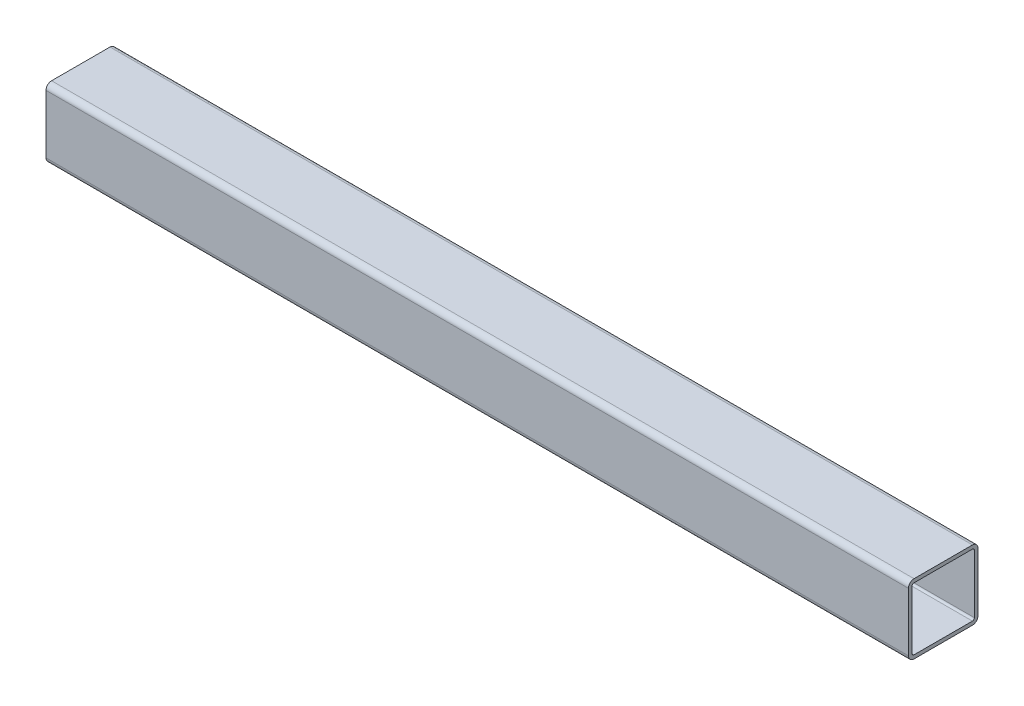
ISO-10303-21;
HEADER;
FILE_DESCRIPTION(('STEP AP214'),'2;1');
FILE_NAME('part.step','',(''),(''),'','','');
FILE_SCHEMA(('AUTOMOTIVE_DESIGN { 1 0 10303 214 1 1 1 1 }'));
ENDSEC;
DATA;
#1=APPLICATION_CONTEXT('core data for automotive mechanical design processes');
#2=APPLICATION_PROTOCOL_DEFINITION('international standard','automotive_design',2000,#1);
#3=PRODUCT_CONTEXT('',#1,'mechanical');
#4=PRODUCT('Part','Part','',(#3));
#5=PRODUCT_RELATED_PRODUCT_CATEGORY('part','',(#4));
#6=PRODUCT_DEFINITION_FORMATION('','',#4);
#7=PRODUCT_DEFINITION_CONTEXT('part definition',#1,'design');
#8=PRODUCT_DEFINITION('design','',#6,#7);
#9=PRODUCT_DEFINITION_SHAPE('','',#8);
#10=(LENGTH_UNIT() NAMED_UNIT(*) SI_UNIT(.MILLI.,.METRE.));
#11=(NAMED_UNIT(*) PLANE_ANGLE_UNIT() SI_UNIT($,.RADIAN.));
#12=(NAMED_UNIT(*) SI_UNIT($,.STERADIAN.) SOLID_ANGLE_UNIT());
#13=UNCERTAINTY_MEASURE_WITH_UNIT(LENGTH_MEASURE(1.E-05),#10,'distance_accuracy_value','');
#14=(GEOMETRIC_REPRESENTATION_CONTEXT(3) GLOBAL_UNCERTAINTY_ASSIGNED_CONTEXT((#13)) GLOBAL_UNIT_ASSIGNED_CONTEXT((#10,
#11,#12)) REPRESENTATION_CONTEXT('',''));
#15=CARTESIAN_POINT('',(0.,0.,0.));
#16=DIRECTION('',(0.,0.,1.));
#17=DIRECTION('',(1.,0.,0.));
#18=AXIS2_PLACEMENT_3D('',#15,#16,#17);
#19=CARTESIAN_POINT('',(393.7,2.54,29.21));
#20=DIRECTION('',(1.,0.,0.));
#21=DIRECTION('',(0.,0.,-1.));
#22=AXIS2_PLACEMENT_3D('',#19,#20,#21);
#23=PLANE('',#22);
#24=CARTESIAN_POINT('',(393.7,2.54,29.21));
#25=DIRECTION('',(1.,0.,0.));
#26=DIRECTION('',(0.,0.,-1.));
#27=AXIS2_PLACEMENT_3D('',#24,#25,#26);
#28=CIRCLE('',#27,2.54);
#29=CARTESIAN_POINT('',(393.7,2.54000000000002,31.75));
#30=VERTEX_POINT('',#29);
#31=CARTESIAN_POINT('',(393.7,0.,29.21));
#32=VERTEX_POINT('',#31);
#33=EDGE_CURVE('E217',#30,#32,#28,.T.);
#34=ORIENTED_EDGE('',*,*,#33,.T.);
#35=DIRECTION('',(0.,0.,-1.));
#36=VECTOR('',#35,1.);
#37=CARTESIAN_POINT('',(393.7,0.,29.21));
#38=LINE('',#37,#36);
#39=CARTESIAN_POINT('',(393.7,0.,2.54000000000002));
#40=VERTEX_POINT('',#39);
#41=EDGE_CURVE('E220',#32,#40,#38,.T.);
#42=ORIENTED_EDGE('',*,*,#41,.T.);
#43=CARTESIAN_POINT('',(393.7,2.54,2.54));
#44=DIRECTION('',(1.,0.,0.));
#45=DIRECTION('',(0.,0.,1.));
#46=AXIS2_PLACEMENT_3D('',#43,#44,#45);
#47=CIRCLE('',#46,2.54);
#48=CARTESIAN_POINT('',(393.7,2.54000000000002,0.));
#49=VERTEX_POINT('',#48);
#50=EDGE_CURVE('E223',#40,#49,#47,.T.);
#51=ORIENTED_EDGE('',*,*,#50,.T.);
#52=DIRECTION('',(0.,1.,0.));
#53=VECTOR('',#52,1.);
#54=CARTESIAN_POINT('',(393.7,2.54000000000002,0.));
#55=LINE('',#54,#53);
#56=CARTESIAN_POINT('',(393.7,29.21,0.));
#57=VERTEX_POINT('',#56);
#58=EDGE_CURVE('E225',#49,#57,#55,.T.);
#59=ORIENTED_EDGE('',*,*,#58,.T.);
#60=CARTESIAN_POINT('',(393.7,29.21,2.54));
#61=DIRECTION('',(1.,0.,0.));
#62=DIRECTION('',(0.,0.,-1.));
#63=AXIS2_PLACEMENT_3D('',#60,#61,#62);
#64=CIRCLE('',#63,2.54);
#65=CARTESIAN_POINT('',(393.7,31.75,2.54000000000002));
#66=VERTEX_POINT('',#65);
#67=EDGE_CURVE('E227',#57,#66,#64,.T.);
#68=ORIENTED_EDGE('',*,*,#67,.T.);
#69=DIRECTION('',(0.,0.,1.));
#70=VECTOR('',#69,1.);
#71=CARTESIAN_POINT('',(393.7,31.75,2.54000000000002));
#72=LINE('',#71,#70);
#73=CARTESIAN_POINT('',(393.7,31.75,29.21));
#74=VERTEX_POINT('',#73);
#75=EDGE_CURVE('E229',#66,#74,#72,.T.);
#76=ORIENTED_EDGE('',*,*,#75,.T.);
#77=CARTESIAN_POINT('',(393.7,29.21,29.21));
#78=DIRECTION('',(1.,0.,0.));
#79=DIRECTION('',(0.,0.,1.));
#80=AXIS2_PLACEMENT_3D('',#77,#78,#79);
#81=CIRCLE('',#80,2.54);
#82=CARTESIAN_POINT('',(393.7,29.21,31.75));
#83=VERTEX_POINT('',#82);
#84=EDGE_CURVE('E231',#74,#83,#81,.T.);
#85=ORIENTED_EDGE('',*,*,#84,.T.);
#86=DIRECTION('',(0.,-1.,0.));
#87=VECTOR('',#86,1.);
#88=CARTESIAN_POINT('',(393.7,29.21,31.75));
#89=LINE('',#88,#87);
#90=EDGE_CURVE('E233',#83,#30,#89,.T.);
#91=ORIENTED_EDGE('',*,*,#90,.T.);
#92=EDGE_LOOP('',(#34,#42,#51,#59,#68,#76,#85,#91));
#93=FACE_BOUND('',#92,.T.);
#94=DIRECTION('',(0.,1.,0.));
#95=VECTOR('',#94,1.);
#96=CARTESIAN_POINT('',(393.7,2.54000000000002,1.651));
#97=LINE('',#96,#95);
#98=CARTESIAN_POINT('',(393.7,2.54000000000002,1.651));
#99=VERTEX_POINT('',#98);
#100=CARTESIAN_POINT('',(393.7,29.21,1.651));
#101=VERTEX_POINT('',#100);
#102=EDGE_CURVE('E160',#99,#101,#97,.T.);
#103=ORIENTED_EDGE('',*,*,#102,.F.);
#104=CARTESIAN_POINT('',(393.7,2.54,2.54));
#105=DIRECTION('',(1.,0.,0.));
#106=DIRECTION('',(0.,0.,1.));
#107=AXIS2_PLACEMENT_3D('',#104,#105,#106);
#108=CIRCLE('',#107,0.889);
#109=CARTESIAN_POINT('',(393.7,1.651,2.54000000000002));
#110=VERTEX_POINT('',#109);
#111=EDGE_CURVE('E152',#110,#99,#108,.T.);
#112=ORIENTED_EDGE('',*,*,#111,.F.);
#113=DIRECTION('',(0.,0.,-1.));
#114=VECTOR('',#113,1.);
#115=CARTESIAN_POINT('',(393.7,1.651,29.21));
#116=LINE('',#115,#114);
#117=CARTESIAN_POINT('',(393.7,1.651,29.21));
#118=VERTEX_POINT('',#117);
#119=EDGE_CURVE('E185',#118,#110,#116,.T.);
#120=ORIENTED_EDGE('',*,*,#119,.F.);
#121=CARTESIAN_POINT('',(393.7,2.54,29.21));
#122=DIRECTION('',(1.,0.,0.));
#123=DIRECTION('',(0.,0.,-1.));
#124=AXIS2_PLACEMENT_3D('',#121,#122,#123);
#125=CIRCLE('',#124,0.889000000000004);
#126=CARTESIAN_POINT('',(393.7,2.54000000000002,30.099));
#127=VERTEX_POINT('',#126);
#128=EDGE_CURVE('E183',#127,#118,#125,.T.);
#129=ORIENTED_EDGE('',*,*,#128,.F.);
#130=DIRECTION('',(0.,-1.,0.));
#131=VECTOR('',#130,1.);
#132=CARTESIAN_POINT('',(393.7,29.21,30.099));
#133=LINE('',#132,#131);
#134=CARTESIAN_POINT('',(393.7,29.21,30.099));
#135=VERTEX_POINT('',#134);
#136=EDGE_CURVE('E181',#135,#127,#133,.T.);
#137=ORIENTED_EDGE('',*,*,#136,.F.);
#138=CARTESIAN_POINT('',(393.7,29.21,29.21));
#139=DIRECTION('',(1.,0.,0.));
#140=DIRECTION('',(0.,0.,1.));
#141=AXIS2_PLACEMENT_3D('',#138,#139,#140);
#142=CIRCLE('',#141,0.889000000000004);
#143=CARTESIAN_POINT('',(393.7,30.099,29.21));
#144=VERTEX_POINT('',#143);
#145=EDGE_CURVE('E179',#144,#135,#142,.T.);
#146=ORIENTED_EDGE('',*,*,#145,.F.);
#147=DIRECTION('',(0.,0.,1.));
#148=VECTOR('',#147,1.);
#149=CARTESIAN_POINT('',(393.7,30.099,2.54000000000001));
#150=LINE('',#149,#148);
#151=CARTESIAN_POINT('',(393.7,30.099,2.54000000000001));
#152=VERTEX_POINT('',#151);
#153=EDGE_CURVE('E175',#152,#144,#150,.T.);
#154=ORIENTED_EDGE('',*,*,#153,.F.);
#155=CARTESIAN_POINT('',(393.7,29.21,2.54));
#156=DIRECTION('',(1.,0.,0.));
#157=DIRECTION('',(0.,0.,-1.));
#158=AXIS2_PLACEMENT_3D('',#155,#156,#157);
#159=CIRCLE('',#158,0.889);
#160=EDGE_CURVE('E173',#101,#152,#159,.T.);
#161=ORIENTED_EDGE('',*,*,#160,.F.);
#162=EDGE_LOOP('',(#103,#112,#120,#129,#137,#146,#154,#161));
#163=FACE_BOUND('',#162,.T.);
#164=ADVANCED_FACE('F39',(#93,#163),#23,.T.);
#165=CARTESIAN_POINT('',(0.,2.54,29.21));
#166=DIRECTION('',(1.,0.,0.));
#167=DIRECTION('',(0.,0.,-1.));
#168=AXIS2_PLACEMENT_3D('',#165,#166,#167);
#169=PLANE('',#168);
#170=CARTESIAN_POINT('',(0.,2.54,29.21));
#171=DIRECTION('',(1.,0.,0.));
#172=DIRECTION('',(0.,0.,-1.));
#173=AXIS2_PLACEMENT_3D('',#170,#171,#172);
#174=CIRCLE('',#173,2.54);
#175=CARTESIAN_POINT('',(0.,2.54000000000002,31.75));
#176=VERTEX_POINT('',#175);
#177=CARTESIAN_POINT('',(0.,0.,29.21));
#178=VERTEX_POINT('',#177);
#179=EDGE_CURVE('E168',#176,#178,#174,.T.);
#180=ORIENTED_EDGE('',*,*,#179,.F.);
#181=DIRECTION('',(0.,-1.,0.));
#182=VECTOR('',#181,1.);
#183=CARTESIAN_POINT('',(0.,29.21,31.75));
#184=LINE('',#183,#182);
#185=CARTESIAN_POINT('',(0.,29.21,31.75));
#186=VERTEX_POINT('',#185);
#187=EDGE_CURVE('E221',#186,#176,#184,.T.);
#188=ORIENTED_EDGE('',*,*,#187,.F.);
#189=CARTESIAN_POINT('',(0.,29.21,29.21));
#190=DIRECTION('',(1.,0.,0.));
#191=DIRECTION('',(0.,0.,1.));
#192=AXIS2_PLACEMENT_3D('',#189,#190,#191);
#193=CIRCLE('',#192,2.54);
#194=CARTESIAN_POINT('',(0.,31.75,29.21));
#195=VERTEX_POINT('',#194);
#196=EDGE_CURVE('E248',#195,#186,#193,.T.);
#197=ORIENTED_EDGE('',*,*,#196,.F.);
#198=DIRECTION('',(0.,0.,1.));
#199=VECTOR('',#198,1.);
#200=CARTESIAN_POINT('',(0.,31.75,2.54000000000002));
#201=LINE('',#200,#199);
#202=CARTESIAN_POINT('',(0.,31.75,2.54000000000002));
#203=VERTEX_POINT('',#202);
#204=EDGE_CURVE('E246',#203,#195,#201,.T.);
#205=ORIENTED_EDGE('',*,*,#204,.F.);
#206=CARTESIAN_POINT('',(0.,29.21,2.54));
#207=DIRECTION('',(1.,0.,0.));
#208=DIRECTION('',(0.,0.,-1.));
#209=AXIS2_PLACEMENT_3D('',#206,#207,#208);
#210=CIRCLE('',#209,2.54);
#211=CARTESIAN_POINT('',(0.,29.21,0.));
#212=VERTEX_POINT('',#211);
#213=EDGE_CURVE('E244',#212,#203,#210,.T.);
#214=ORIENTED_EDGE('',*,*,#213,.F.);
#215=DIRECTION('',(0.,1.,0.));
#216=VECTOR('',#215,1.);
#217=CARTESIAN_POINT('',(0.,2.54000000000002,0.));
#218=LINE('',#217,#216);
#219=CARTESIAN_POINT('',(0.,2.54000000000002,0.));
#220=VERTEX_POINT('',#219);
#221=EDGE_CURVE('E242',#220,#212,#218,.T.);
#222=ORIENTED_EDGE('',*,*,#221,.F.);
#223=CARTESIAN_POINT('',(0.,2.54,2.54));
#224=DIRECTION('',(1.,0.,0.));
#225=DIRECTION('',(0.,0.,1.));
#226=AXIS2_PLACEMENT_3D('',#223,#224,#225);
#227=CIRCLE('',#226,2.54);
#228=CARTESIAN_POINT('',(0.,0.,2.54000000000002));
#229=VERTEX_POINT('',#228);
#230=EDGE_CURVE('E240',#229,#220,#227,.T.);
#231=ORIENTED_EDGE('',*,*,#230,.F.);
#232=DIRECTION('',(0.,0.,-1.));
#233=VECTOR('',#232,1.);
#234=CARTESIAN_POINT('',(0.,0.,29.21));
#235=LINE('',#234,#233);
#236=EDGE_CURVE('E238',#178,#229,#235,.T.);
#237=ORIENTED_EDGE('',*,*,#236,.F.);
#238=EDGE_LOOP('',(#180,#188,#197,#205,#214,#222,#231,#237));
#239=FACE_BOUND('',#238,.T.);
#240=CARTESIAN_POINT('',(0.,2.54,2.54));
#241=DIRECTION('',(1.,0.,0.));
#242=DIRECTION('',(0.,0.,1.));
#243=AXIS2_PLACEMENT_3D('',#240,#241,#242);
#244=CIRCLE('',#243,0.889);
#245=CARTESIAN_POINT('',(0.,1.651,2.54000000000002));
#246=VERTEX_POINT('',#245);
#247=CARTESIAN_POINT('',(0.,2.54000000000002,1.651));
#248=VERTEX_POINT('',#247);
#249=EDGE_CURVE('E62',#246,#248,#244,.T.);
#250=ORIENTED_EDGE('',*,*,#249,.T.);
#251=DIRECTION('',(0.,1.,0.));
#252=VECTOR('',#251,1.);
#253=CARTESIAN_POINT('',(0.,2.54000000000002,1.651));
#254=LINE('',#253,#252);
#255=CARTESIAN_POINT('',(0.,29.21,1.651));
#256=VERTEX_POINT('',#255);
#257=EDGE_CURVE('E167',#248,#256,#254,.T.);
#258=ORIENTED_EDGE('',*,*,#257,.T.);
#259=CARTESIAN_POINT('',(0.,29.21,2.54));
#260=DIRECTION('',(1.,0.,0.));
#261=DIRECTION('',(0.,0.,-1.));
#262=AXIS2_PLACEMENT_3D('',#259,#260,#261);
#263=CIRCLE('',#262,0.889);
#264=CARTESIAN_POINT('',(0.,30.099,2.54000000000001));
#265=VERTEX_POINT('',#264);
#266=EDGE_CURVE('E189',#256,#265,#263,.T.);
#267=ORIENTED_EDGE('',*,*,#266,.T.);
#268=DIRECTION('',(0.,0.,1.));
#269=VECTOR('',#268,1.);
#270=CARTESIAN_POINT('',(0.,30.099,2.54000000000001));
#271=LINE('',#270,#269);
#272=CARTESIAN_POINT('',(0.,30.099,29.21));
#273=VERTEX_POINT('',#272);
#274=EDGE_CURVE('E192',#265,#273,#271,.T.);
#275=ORIENTED_EDGE('',*,*,#274,.T.);
#276=CARTESIAN_POINT('',(0.,29.21,29.21));
#277=DIRECTION('',(1.,0.,0.));
#278=DIRECTION('',(0.,0.,1.));
#279=AXIS2_PLACEMENT_3D('',#276,#277,#278);
#280=CIRCLE('',#279,0.889000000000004);
#281=CARTESIAN_POINT('',(0.,29.21,30.099));
#282=VERTEX_POINT('',#281);
#283=EDGE_CURVE('E195',#273,#282,#280,.T.);
#284=ORIENTED_EDGE('',*,*,#283,.T.);
#285=DIRECTION('',(0.,-1.,0.));
#286=VECTOR('',#285,1.);
#287=CARTESIAN_POINT('',(0.,29.21,30.099));
#288=LINE('',#287,#286);
#289=CARTESIAN_POINT('',(0.,2.54000000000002,30.099));
#290=VERTEX_POINT('',#289);
#291=EDGE_CURVE('E198',#282,#290,#288,.T.);
#292=ORIENTED_EDGE('',*,*,#291,.T.);
#293=CARTESIAN_POINT('',(0.,2.54,29.21));
#294=DIRECTION('',(1.,0.,0.));
#295=DIRECTION('',(0.,0.,-1.));
#296=AXIS2_PLACEMENT_3D('',#293,#294,#295);
#297=CIRCLE('',#296,0.889000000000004);
#298=CARTESIAN_POINT('',(0.,1.651,29.21));
#299=VERTEX_POINT('',#298);
#300=EDGE_CURVE('E201',#290,#299,#297,.T.);
#301=ORIENTED_EDGE('',*,*,#300,.T.);
#302=DIRECTION('',(0.,0.,-1.));
#303=VECTOR('',#302,1.);
#304=CARTESIAN_POINT('',(0.,1.651,29.21));
#305=LINE('',#304,#303);
#306=EDGE_CURVE('E161',#299,#246,#305,.T.);
#307=ORIENTED_EDGE('',*,*,#306,.T.);
#308=EDGE_LOOP('',(#250,#258,#267,#275,#284,#292,#301,#307));
#309=FACE_BOUND('',#308,.T.);
#310=ADVANCED_FACE('F278',(#239,#309),#169,.F.);
#311=CARTESIAN_POINT('',(393.7,2.54,29.21));
#312=DIRECTION('',(-1.,0.,0.));
#313=DIRECTION('',(0.,0.,1.));
#314=AXIS2_PLACEMENT_3D('',#311,#312,#313);
#315=CYLINDRICAL_SURFACE('',#314,2.54);
#316=ORIENTED_EDGE('',*,*,#179,.T.);
#317=DIRECTION('',(-1.,0.,0.));
#318=VECTOR('',#317,1.);
#319=CARTESIAN_POINT('',(393.7,0.,29.21));
#320=LINE('',#319,#318);
#321=EDGE_CURVE('E11',#32,#178,#320,.T.);
#322=ORIENTED_EDGE('',*,*,#321,.F.);
#323=ORIENTED_EDGE('',*,*,#33,.F.);
#324=DIRECTION('',(-1.,0.,0.));
#325=VECTOR('',#324,1.);
#326=CARTESIAN_POINT('',(393.7,2.54000000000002,31.75));
#327=LINE('',#326,#325);
#328=EDGE_CURVE('E235',#30,#176,#327,.T.);
#329=ORIENTED_EDGE('',*,*,#328,.T.);
#330=EDGE_LOOP('',(#316,#322,#323,#329));
#331=FACE_BOUND('',#330,.T.);
#332=ADVANCED_FACE('F41',(#331),#315,.T.);
#333=CARTESIAN_POINT('',(393.7,0.,29.21));
#334=DIRECTION('',(0.,1.,0.));
#335=DIRECTION('',(0.,0.,1.));
#336=AXIS2_PLACEMENT_3D('',#333,#334,#335);
#337=PLANE('',#336);
#338=ORIENTED_EDGE('',*,*,#236,.T.);
#339=DIRECTION('',(-1.,0.,0.));
#340=VECTOR('',#339,1.);
#341=CARTESIAN_POINT('',(393.7,0.,2.54000000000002));
#342=LINE('',#341,#340);
#343=EDGE_CURVE('E47',#40,#229,#342,.T.);
#344=ORIENTED_EDGE('',*,*,#343,.F.);
#345=ORIENTED_EDGE('',*,*,#41,.F.);
#346=ORIENTED_EDGE('',*,*,#321,.T.);
#347=EDGE_LOOP('',(#338,#344,#345,#346));
#348=FACE_BOUND('',#347,.T.);
#349=ADVANCED_FACE('F295',(#348),#337,.F.);
#350=CARTESIAN_POINT('',(393.7,2.54,2.54));
#351=DIRECTION('',(-1.,0.,0.));
#352=DIRECTION('',(0.,0.,1.));
#353=AXIS2_PLACEMENT_3D('',#350,#351,#352);
#354=CYLINDRICAL_SURFACE('',#353,2.54);
#355=ORIENTED_EDGE('',*,*,#230,.T.);
#356=DIRECTION('',(-1.,0.,0.));
#357=VECTOR('',#356,1.);
#358=CARTESIAN_POINT('',(393.7,2.54000000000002,0.));
#359=LINE('',#358,#357);
#360=EDGE_CURVE('E265',#49,#220,#359,.T.);
#361=ORIENTED_EDGE('',*,*,#360,.F.);
#362=ORIENTED_EDGE('',*,*,#50,.F.);
#363=ORIENTED_EDGE('',*,*,#343,.T.);
#364=EDGE_LOOP('',(#355,#361,#362,#363));
#365=FACE_BOUND('',#364,.T.);
#366=ADVANCED_FACE('F272',(#365),#354,.T.);
#367=CARTESIAN_POINT('',(393.7,2.54000000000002,0.));
#368=DIRECTION('',(0.,0.,1.));
#369=DIRECTION('',(1.,0.,0.));
#370=AXIS2_PLACEMENT_3D('',#367,#368,#369);
#371=PLANE('',#370);
#372=ORIENTED_EDGE('',*,*,#221,.T.);
#373=DIRECTION('',(-1.,0.,0.));
#374=VECTOR('',#373,1.);
#375=CARTESIAN_POINT('',(393.7,29.21,0.));
#376=LINE('',#375,#374);
#377=EDGE_CURVE('E262',#57,#212,#376,.T.);
#378=ORIENTED_EDGE('',*,*,#377,.F.);
#379=ORIENTED_EDGE('',*,*,#58,.F.);
#380=ORIENTED_EDGE('',*,*,#360,.T.);
#381=EDGE_LOOP('',(#372,#378,#379,#380));
#382=FACE_BOUND('',#381,.T.);
#383=ADVANCED_FACE('F284',(#382),#371,.F.);
#384=CARTESIAN_POINT('',(393.7,29.21,2.54));
#385=DIRECTION('',(-1.,0.,0.));
#386=DIRECTION('',(0.,0.,1.));
#387=AXIS2_PLACEMENT_3D('',#384,#385,#386);
#388=CYLINDRICAL_SURFACE('',#387,2.54);
#389=ORIENTED_EDGE('',*,*,#213,.T.);
#390=DIRECTION('',(-1.,0.,0.));
#391=VECTOR('',#390,1.);
#392=CARTESIAN_POINT('',(393.7,31.75,2.54000000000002));
#393=LINE('',#392,#391);
#394=EDGE_CURVE('E259',#66,#203,#393,.T.);
#395=ORIENTED_EDGE('',*,*,#394,.F.);
#396=ORIENTED_EDGE('',*,*,#67,.F.);
#397=ORIENTED_EDGE('',*,*,#377,.T.);
#398=EDGE_LOOP('',(#389,#395,#396,#397));
#399=FACE_BOUND('',#398,.T.);
#400=ADVANCED_FACE('F288',(#399),#388,.T.);
#401=CARTESIAN_POINT('',(393.7,31.75,2.54000000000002));
#402=DIRECTION('',(0.,-1.,0.));
#403=DIRECTION('',(0.,0.,-1.));
#404=AXIS2_PLACEMENT_3D('',#401,#402,#403);
#405=PLANE('',#404);
#406=ORIENTED_EDGE('',*,*,#204,.T.);
#407=DIRECTION('',(-1.,0.,0.));
#408=VECTOR('',#407,1.);
#409=CARTESIAN_POINT('',(393.7,31.75,29.21));
#410=LINE('',#409,#408);
#411=EDGE_CURVE('E256',#74,#195,#410,.T.);
#412=ORIENTED_EDGE('',*,*,#411,.F.);
#413=ORIENTED_EDGE('',*,*,#75,.F.);
#414=ORIENTED_EDGE('',*,*,#394,.T.);
#415=EDGE_LOOP('',(#406,#412,#413,#414));
#416=FACE_BOUND('',#415,.T.);
#417=ADVANCED_FACE('F308',(#416),#405,.F.);
#418=CARTESIAN_POINT('',(393.7,29.21,29.21));
#419=DIRECTION('',(-1.,0.,0.));
#420=DIRECTION('',(0.,0.,1.));
#421=AXIS2_PLACEMENT_3D('',#418,#419,#420);
#422=CYLINDRICAL_SURFACE('',#421,2.54);
#423=ORIENTED_EDGE('',*,*,#196,.T.);
#424=DIRECTION('',(-1.,0.,0.));
#425=VECTOR('',#424,1.);
#426=CARTESIAN_POINT('',(393.7,29.21,31.75));
#427=LINE('',#426,#425);
#428=EDGE_CURVE('E253',#83,#186,#427,.T.);
#429=ORIENTED_EDGE('',*,*,#428,.F.);
#430=ORIENTED_EDGE('',*,*,#84,.F.);
#431=ORIENTED_EDGE('',*,*,#411,.T.);
#432=EDGE_LOOP('',(#423,#429,#430,#431));
#433=FACE_BOUND('',#432,.T.);
#434=ADVANCED_FACE('F306',(#433),#422,.T.);
#435=CARTESIAN_POINT('',(393.7,29.21,31.75));
#436=DIRECTION('',(0.,0.,-1.));
#437=DIRECTION('',(0.,1.,0.));
#438=AXIS2_PLACEMENT_3D('',#435,#436,#437);
#439=PLANE('',#438);
#440=ORIENTED_EDGE('',*,*,#187,.T.);
#441=ORIENTED_EDGE('',*,*,#328,.F.);
#442=ORIENTED_EDGE('',*,*,#90,.F.);
#443=ORIENTED_EDGE('',*,*,#428,.T.);
#444=EDGE_LOOP('',(#440,#441,#442,#443));
#445=FACE_BOUND('',#444,.T.);
#446=ADVANCED_FACE('F301',(#445),#439,.F.);
#447=CARTESIAN_POINT('',(393.7,2.54,2.54));
#448=DIRECTION('',(-1.,0.,0.));
#449=DIRECTION('',(0.,0.,1.));
#450=AXIS2_PLACEMENT_3D('',#447,#448,#449);
#451=CYLINDRICAL_SURFACE('',#450,0.889);
#452=ORIENTED_EDGE('',*,*,#249,.F.);
#453=DIRECTION('',(-1.,0.,0.));
#454=VECTOR('',#453,1.);
#455=CARTESIAN_POINT('',(393.7,1.651,2.54000000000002));
#456=LINE('',#455,#454);
#457=EDGE_CURVE('E156',#110,#246,#456,.T.);
#458=ORIENTED_EDGE('',*,*,#457,.F.);
#459=ORIENTED_EDGE('',*,*,#111,.T.);
#460=DIRECTION('',(-1.,0.,0.));
#461=VECTOR('',#460,1.);
#462=CARTESIAN_POINT('',(393.7,2.54000000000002,1.651));
#463=LINE('',#462,#461);
#464=EDGE_CURVE('E155',#99,#248,#463,.T.);
#465=ORIENTED_EDGE('',*,*,#464,.T.);
#466=EDGE_LOOP('',(#452,#458,#459,#465));
#467=FACE_BOUND('',#466,.T.);
#468=ADVANCED_FACE('F154',(#467),#451,.F.);
#469=CARTESIAN_POINT('',(393.7,2.54000000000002,1.651));
#470=DIRECTION('',(0.,0.,1.));
#471=DIRECTION('',(1.,0.,0.));
#472=AXIS2_PLACEMENT_3D('',#469,#470,#471);
#473=PLANE('',#472);
#474=ORIENTED_EDGE('',*,*,#257,.F.);
#475=ORIENTED_EDGE('',*,*,#464,.F.);
#476=ORIENTED_EDGE('',*,*,#102,.T.);
#477=DIRECTION('',(-1.,0.,0.));
#478=VECTOR('',#477,1.);
#479=CARTESIAN_POINT('',(393.7,29.21,1.651));
#480=LINE('',#479,#478);
#481=EDGE_CURVE('E169',#101,#256,#480,.T.);
#482=ORIENTED_EDGE('',*,*,#481,.T.);
#483=EDGE_LOOP('',(#474,#475,#476,#482));
#484=FACE_BOUND('',#483,.T.);
#485=ADVANCED_FACE('F164',(#484),#473,.T.);
#486=CARTESIAN_POINT('',(393.7,29.21,2.54));
#487=DIRECTION('',(-1.,0.,0.));
#488=DIRECTION('',(0.,0.,1.));
#489=AXIS2_PLACEMENT_3D('',#486,#487,#488);
#490=CYLINDRICAL_SURFACE('',#489,0.889);
#491=ORIENTED_EDGE('',*,*,#266,.F.);
#492=ORIENTED_EDGE('',*,*,#481,.F.);
#493=ORIENTED_EDGE('',*,*,#160,.T.);
#494=DIRECTION('',(-1.,0.,0.));
#495=VECTOR('',#494,1.);
#496=CARTESIAN_POINT('',(393.7,30.099,2.54000000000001));
#497=LINE('',#496,#495);
#498=EDGE_CURVE('E214',#152,#265,#497,.T.);
#499=ORIENTED_EDGE('',*,*,#498,.T.);
#500=EDGE_LOOP('',(#491,#492,#493,#499));
#501=FACE_BOUND('',#500,.T.);
#502=ADVANCED_FACE('F333',(#501),#490,.F.);
#503=CARTESIAN_POINT('',(393.7,30.099,2.54000000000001));
#504=DIRECTION('',(0.,-1.,0.));
#505=DIRECTION('',(0.,0.,-1.));
#506=AXIS2_PLACEMENT_3D('',#503,#504,#505);
#507=PLANE('',#506);
#508=ORIENTED_EDGE('',*,*,#274,.F.);
#509=ORIENTED_EDGE('',*,*,#498,.F.);
#510=ORIENTED_EDGE('',*,*,#153,.T.);
#511=DIRECTION('',(-1.,0.,0.));
#512=VECTOR('',#511,1.);
#513=CARTESIAN_POINT('',(393.7,30.099,29.21));
#514=LINE('',#513,#512);
#515=EDGE_CURVE('E212',#144,#273,#514,.T.);
#516=ORIENTED_EDGE('',*,*,#515,.T.);
#517=EDGE_LOOP('',(#508,#509,#510,#516));
#518=FACE_BOUND('',#517,.T.);
#519=ADVANCED_FACE('F337',(#518),#507,.T.);
#520=CARTESIAN_POINT('',(393.7,29.21,29.21));
#521=DIRECTION('',(-1.,0.,0.));
#522=DIRECTION('',(0.,0.,1.));
#523=AXIS2_PLACEMENT_3D('',#520,#521,#522);
#524=CYLINDRICAL_SURFACE('',#523,0.889000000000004);
#525=ORIENTED_EDGE('',*,*,#283,.F.);
#526=ORIENTED_EDGE('',*,*,#515,.F.);
#527=ORIENTED_EDGE('',*,*,#145,.T.);
#528=DIRECTION('',(-1.,0.,0.));
#529=VECTOR('',#528,1.);
#530=CARTESIAN_POINT('',(393.7,29.21,30.099));
#531=LINE('',#530,#529);
#532=EDGE_CURVE('E210',#135,#282,#531,.T.);
#533=ORIENTED_EDGE('',*,*,#532,.T.);
#534=EDGE_LOOP('',(#525,#526,#527,#533));
#535=FACE_BOUND('',#534,.T.);
#536=ADVANCED_FACE('F343',(#535),#524,.F.);
#537=CARTESIAN_POINT('',(393.7,29.21,30.099));
#538=DIRECTION('',(0.,0.,-1.));
#539=DIRECTION('',(-1.,0.,0.));
#540=AXIS2_PLACEMENT_3D('',#537,#538,#539);
#541=PLANE('',#540);
#542=ORIENTED_EDGE('',*,*,#291,.F.);
#543=ORIENTED_EDGE('',*,*,#532,.F.);
#544=ORIENTED_EDGE('',*,*,#136,.T.);
#545=DIRECTION('',(-1.,0.,0.));
#546=VECTOR('',#545,1.);
#547=CARTESIAN_POINT('',(393.7,2.54000000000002,30.099));
#548=LINE('',#547,#546);
#549=EDGE_CURVE('E208',#127,#290,#548,.T.);
#550=ORIENTED_EDGE('',*,*,#549,.T.);
#551=EDGE_LOOP('',(#542,#543,#544,#550));
#552=FACE_BOUND('',#551,.T.);
#553=ADVANCED_FACE('F347',(#552),#541,.T.);
#554=CARTESIAN_POINT('',(393.7,2.54,29.21));
#555=DIRECTION('',(-1.,0.,0.));
#556=DIRECTION('',(0.,0.,1.));
#557=AXIS2_PLACEMENT_3D('',#554,#555,#556);
#558=CYLINDRICAL_SURFACE('',#557,0.889000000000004);
#559=ORIENTED_EDGE('',*,*,#300,.F.);
#560=ORIENTED_EDGE('',*,*,#549,.F.);
#561=ORIENTED_EDGE('',*,*,#128,.T.);
#562=DIRECTION('',(-1.,0.,0.));
#563=VECTOR('',#562,1.);
#564=CARTESIAN_POINT('',(393.7,1.651,29.21));
#565=LINE('',#564,#563);
#566=EDGE_CURVE('E54',#118,#299,#565,.T.);
#567=ORIENTED_EDGE('',*,*,#566,.T.);
#568=EDGE_LOOP('',(#559,#560,#561,#567));
#569=FACE_BOUND('',#568,.T.);
#570=ADVANCED_FACE('F351',(#569),#558,.F.);
#571=CARTESIAN_POINT('',(393.7,1.651,29.21));
#572=DIRECTION('',(0.,1.,0.));
#573=DIRECTION('',(0.,0.,1.));
#574=AXIS2_PLACEMENT_3D('',#571,#572,#573);
#575=PLANE('',#574);
#576=ORIENTED_EDGE('',*,*,#306,.F.);
#577=ORIENTED_EDGE('',*,*,#566,.F.);
#578=ORIENTED_EDGE('',*,*,#119,.T.);
#579=ORIENTED_EDGE('',*,*,#457,.T.);
#580=EDGE_LOOP('',(#576,#577,#578,#579));
#581=FACE_BOUND('',#580,.T.);
#582=ADVANCED_FACE('F355',(#581),#575,.T.);
#583=CLOSED_SHELL('',(#164,#310,#332,#349,#366,#383,#400,#417,#434,#446,#468,#485,#502,#519,
#536,#553,#570,#582));
#584=MANIFOLD_SOLID_BREP('B2',#583);
#585=ADVANCED_BREP_SHAPE_REPRESENTATION('',(#18,#584),#14);
#586=SHAPE_DEFINITION_REPRESENTATION(#9,#585);
ENDSEC;
END-ISO-10303-21;
